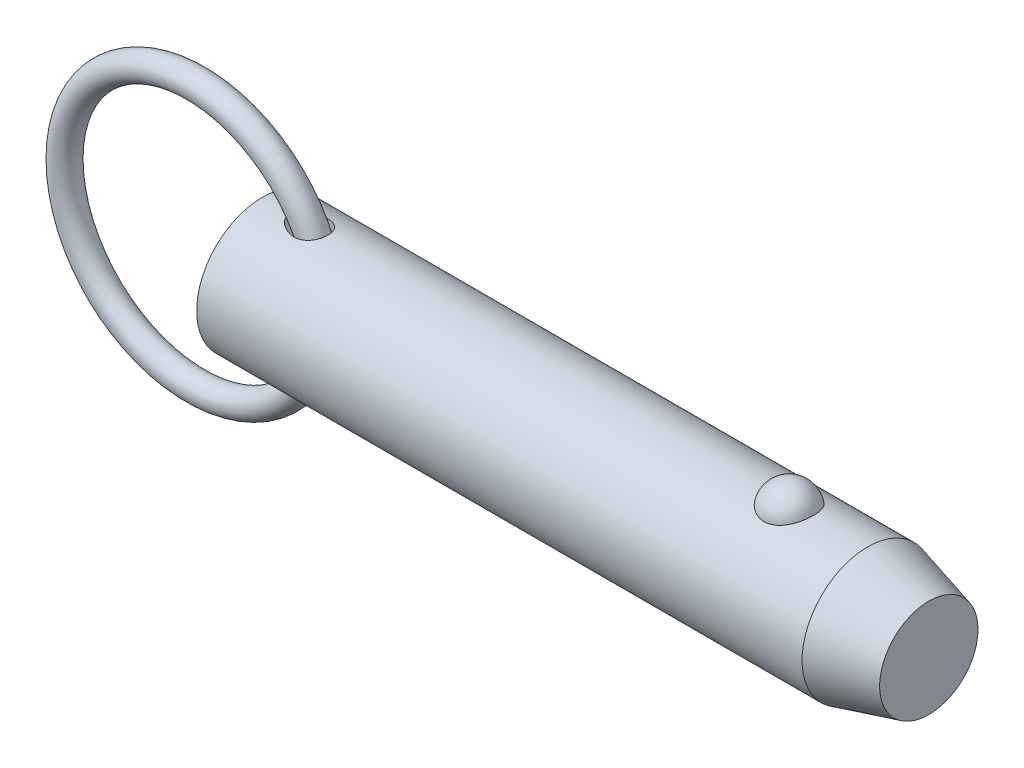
ISO-10303-21;
HEADER;
FILE_DESCRIPTION(('STEP AP214'),'2;1');
FILE_NAME('part.step','',(''),(''),'','','');
FILE_SCHEMA(('AUTOMOTIVE_DESIGN { 1 0 10303 214 1 1 1 1 }'));
ENDSEC;
DATA;
#1=APPLICATION_CONTEXT('core data for automotive mechanical design processes');
#2=APPLICATION_PROTOCOL_DEFINITION('international standard','automotive_design',2000,#1);
#3=PRODUCT_CONTEXT('',#1,'mechanical');
#4=PRODUCT('Part','Part','',(#3));
#5=PRODUCT_RELATED_PRODUCT_CATEGORY('part','',(#4));
#6=PRODUCT_DEFINITION_FORMATION('','',#4);
#7=PRODUCT_DEFINITION_CONTEXT('part definition',#1,'design');
#8=PRODUCT_DEFINITION('design','',#6,#7);
#9=PRODUCT_DEFINITION_SHAPE('','',#8);
#10=(LENGTH_UNIT() NAMED_UNIT(*) SI_UNIT(.MILLI.,.METRE.));
#11=(NAMED_UNIT(*) PLANE_ANGLE_UNIT() SI_UNIT($,.RADIAN.));
#12=(NAMED_UNIT(*) SI_UNIT($,.STERADIAN.) SOLID_ANGLE_UNIT());
#13=UNCERTAINTY_MEASURE_WITH_UNIT(LENGTH_MEASURE(1.E-05),#10,'distance_accuracy_value','');
#14=(GEOMETRIC_REPRESENTATION_CONTEXT(3) GLOBAL_UNCERTAINTY_ASSIGNED_CONTEXT((#13)) GLOBAL_UNIT_ASSIGNED_CONTEXT((#10,
#11,#12)) REPRESENTATION_CONTEXT('',''));
#15=CARTESIAN_POINT('',(0.,0.,0.));
#16=DIRECTION('',(0.,0.,1.));
#17=DIRECTION('',(1.,0.,0.));
#18=AXIS2_PLACEMENT_3D('',#15,#16,#17);
#19=CARTESIAN_POINT('',(-9.66825126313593,0.,0.));
#20=DIRECTION('',(0.,0.,1.));
#21=DIRECTION('',(1.,0.,0.));
#22=AXIS2_PLACEMENT_3D('',#19,#20,#21);
#23=TOROIDAL_SURFACE('',#22,19.05,1.905);
#24=CARTESIAN_POINT('',(11.2867487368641,0.,0.));
#25=VERTEX_POINT('',#24);
#26=VERTEX_LOOP('',#25);
#27=FACE_BOUND('',#26,.T.);
#28=ADVANCED_FACE('P0_F12',(#27),#23,.T.);
#29=CLOSED_SHELL('',(#28));
#30=MANIFOLD_SOLID_BREP('P0_B1',#29);
#31=CARTESIAN_POINT('',(0.,0.,0.));
#32=DIRECTION('',(1.,0.,0.));
#33=DIRECTION('',(0.,0.,-1.));
#34=AXIS2_PLACEMENT_3D('',#31,#32,#33);
#35=CYLINDRICAL_SURFACE('',#34,9.525);
#36=CARTESIAN_POINT('',(4.56693409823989,9.4314194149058,-1.33189820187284));
#37=CARTESIAN_POINT('',(4.70260475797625,9.41020313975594,-1.48215931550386));
#38=CARTESIAN_POINT('',(4.85555680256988,9.38755003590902,-1.61683982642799));
#39=CARTESIAN_POINT('',(5.10171959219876,9.35450554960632,-1.79512943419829));
#40=CARTESIAN_POINT('',(5.18674514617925,9.34362629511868,-1.85068909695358));
#41=CARTESIAN_POINT('',(5.3615438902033,9.32258514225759,-1.95392002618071));
#42=CARTESIAN_POINT('',(5.45131542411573,9.31242299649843,-2.00159402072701));
#43=CARTESIAN_POINT('',(5.70070211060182,9.28632120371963,-2.12033289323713));
#44=CARTESIAN_POINT('',(5.86420408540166,9.27146938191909,-2.18362944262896));
#45=CARTESIAN_POINT('',(6.19893345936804,9.24694163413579,-2.28525783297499));
#46=CARTESIAN_POINT('',(6.3701538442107,9.23726110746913,-2.32361187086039));
#47=CARTESIAN_POINT('',(6.73531776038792,9.22400982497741,-2.37575048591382));
#48=CARTESIAN_POINT('',(6.92975826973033,9.22118808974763,-2.38652934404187));
#49=CARTESIAN_POINT('',(7.21995443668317,9.22416297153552,-2.37494980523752));
#50=CARTESIAN_POINT('',(7.31643847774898,9.22635560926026,-2.366466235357));
#51=CARTESIAN_POINT('',(7.50796421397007,9.2331428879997,-2.33985028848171));
#52=CARTESIAN_POINT('',(7.60300650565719,9.23773650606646,-2.32172202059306));
#53=CARTESIAN_POINT('',(7.83273114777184,9.25183311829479,-2.26504721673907));
#54=CARTESIAN_POINT('',(7.96603028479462,9.26261470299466,-2.2209856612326));
#55=CARTESIAN_POINT('',(8.22310899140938,9.28816519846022,-2.1115730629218));
#56=CARTESIAN_POINT('',(8.34689477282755,9.30293147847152,-2.04623606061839));
#57=CARTESIAN_POINT('',(8.58136049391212,9.3349416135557,-1.89485344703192));
#58=CARTESIAN_POINT('',(8.69199721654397,9.35219324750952,-1.8087422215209));
#59=CARTESIAN_POINT('',(8.89592093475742,9.38707016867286,-1.6179918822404));
#60=CARTESIAN_POINT('',(8.98920771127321,9.40469546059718,-1.51335253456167));
#61=CARTESIAN_POINT('',(9.15057731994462,9.43713590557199,-1.29519427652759));
#62=CARTESIAN_POINT('',(9.21980158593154,9.45205440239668,-1.18253282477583));
#63=CARTESIAN_POINT('',(9.33826736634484,9.47856708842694,-0.946802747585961));
#64=CARTESIAN_POINT('',(9.38751161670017,9.49016173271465,-0.823735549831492));
#65=CARTESIAN_POINT('',(9.46423850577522,9.50859378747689,-0.572614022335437));
#66=CARTESIAN_POINT('',(9.4920239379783,9.5154972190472,-0.444656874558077));
#67=CARTESIAN_POINT('',(9.52636926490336,9.5240690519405,-0.185752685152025));
#68=CARTESIAN_POINT('',(9.53292923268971,9.52573747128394,-0.054805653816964));
#69=CARTESIAN_POINT('',(9.52467276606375,9.52365852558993,0.206503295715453));
#70=CARTESIAN_POINT('',(9.50983454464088,9.51990564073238,0.336864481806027));
#71=CARTESIAN_POINT('',(9.45907362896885,9.50737852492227,0.593166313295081));
#72=CARTESIAN_POINT('',(9.42315106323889,9.49860432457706,0.719106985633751));
#73=CARTESIAN_POINT('',(9.3310664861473,9.4769892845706,0.962959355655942));
#74=CARTESIAN_POINT('',(9.27490839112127,9.46414923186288,1.08087260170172));
#75=CARTESIAN_POINT('',(9.14375803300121,9.43581000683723,1.30534632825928));
#76=CARTESIAN_POINT('',(9.06876720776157,9.42031103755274,1.41190767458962));
#77=CARTESIAN_POINT('',(8.90203187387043,9.38836719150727,1.61069439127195));
#78=CARTESIAN_POINT('',(8.81029913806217,9.371922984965,1.70292975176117));
#79=CARTESIAN_POINT('',(8.6126877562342,9.33985045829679,1.87086859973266));
#80=CARTESIAN_POINT('',(8.50680947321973,9.3242221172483,1.94657251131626));
#81=CARTESIAN_POINT('',(8.28220546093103,9.29513431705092,2.08109032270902));
#82=CARTESIAN_POINT('',(8.16329919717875,9.28171415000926,2.13961034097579));
#83=CARTESIAN_POINT('',(7.91756052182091,9.25859072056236,2.23755716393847));
#84=CARTESIAN_POINT('',(7.79072606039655,9.24888842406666,2.27697900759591));
#85=CARTESIAN_POINT('',(7.52377913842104,9.23338749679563,2.33907806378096));
#86=CARTESIAN_POINT('',(7.3833476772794,9.22789571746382,2.36044900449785));
#87=CARTESIAN_POINT('',(7.1008139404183,9.22210229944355,2.3829751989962));
#88=CARTESIAN_POINT('',(6.95871103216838,9.22180269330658,2.38412253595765));
#89=CARTESIAN_POINT('',(6.65642691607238,9.22632724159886,2.36656230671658));
#90=CARTESIAN_POINT('',(6.49641694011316,9.23185415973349,2.3451317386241));
#91=CARTESIAN_POINT('',(6.18115433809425,9.24811737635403,2.28014143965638));
#92=CARTESIAN_POINT('',(6.02590710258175,9.25885936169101,2.23655754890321));
#93=CARTESIAN_POINT('',(5.69904720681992,9.28624254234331,2.12025087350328));
#94=CARTESIAN_POINT('',(5.52873601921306,9.30354853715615,2.04400672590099));
#95=CARTESIAN_POINT('',(5.20289495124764,9.34106989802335,1.86504730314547));
#96=CARTESIAN_POINT('',(5.0473596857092,9.36128419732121,1.76234172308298));
#97=CARTESIAN_POINT('',(4.7928712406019,9.39697639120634,1.55895334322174));
#98=CARTESIAN_POINT('',(4.68938704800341,9.41240250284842,1.46392900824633));
#99=CARTESIAN_POINT('',(4.4984714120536,9.44202586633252,1.25875918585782));
#100=CARTESIAN_POINT('',(4.41101129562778,9.45622528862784,1.1486413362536));
#101=CARTESIAN_POINT('',(4.27502257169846,9.47888210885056,0.94060098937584));
#102=CARTESIAN_POINT('',(4.22216329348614,9.48791121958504,0.845586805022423));
#103=CARTESIAN_POINT('',(4.13241478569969,9.50344321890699,0.648051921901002));
#104=CARTESIAN_POINT('',(4.0955118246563,9.50994827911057,0.545537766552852));
#105=CARTESIAN_POINT('',(4.04043124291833,9.51971586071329,0.334452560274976));
#106=CARTESIAN_POINT('',(4.02240728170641,9.52295176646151,0.225839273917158));
#107=CARTESIAN_POINT('',(4.00750873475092,9.52562364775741,0.00713006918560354));
#108=CARTESIAN_POINT('',(4.01062334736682,9.52506156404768,-0.102965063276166));
#109=CARTESIAN_POINT('',(4.03592967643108,9.52053221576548,-0.306944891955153));
#110=CARTESIAN_POINT('',(4.05571676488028,9.51699426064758,-0.401151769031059));
#111=CARTESIAN_POINT('',(4.10967975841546,9.5074546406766,-0.585176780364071));
#112=CARTESIAN_POINT('',(4.1438599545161,9.50145224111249,-0.674993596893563));
#113=CARTESIAN_POINT('',(4.23261356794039,9.48611703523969,-0.866116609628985));
#114=CARTESIAN_POINT('',(4.28990016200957,9.47635800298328,-0.966121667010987));
#115=CARTESIAN_POINT('',(4.4185657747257,9.45502867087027,-1.15640011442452));
#116=CARTESIAN_POINT('',(4.4899691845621,9.44345524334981,-1.24665623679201));
#117=CARTESIAN_POINT('',(4.56693409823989,9.4314194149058,-1.33189820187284));
#118=B_SPLINE_CURVE_WITH_KNOTS('',3,(#36,#37,#38,#39,#40,#41,#42,#43,#44,#45,#46,#47,#48,#49,
#50,#51,#52,#53,#54,#55,#56,#57,#58,#59,#60,#61,#62,#63,#64,#65,#66,#67,#68,#69,#70,#71,#72,#73,
#74,#75,#76,#77,#78,#79,#80,#81,#82,#83,#84,#85,#86,#87,#88,#89,#90,#91,#92,#93,#94,#95,#96,#97,
#98,#99,#100,#101,#102,#103,#104,#105,#106,#107,#108,#109,#110,#111,#112,#113,#114,#115,#116,
#117),.UNSPECIFIED.,.T.,.F.,(4,2,2,2,2,2,2,2,2,2,2,2,2,2,2,2,2,2,2,2,2,2,2,2,2,2,2,2,2,2,2,2,2,
2,2,2,2,2,2,2,4),(0.,0.609951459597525,0.916123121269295,1.22218863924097,1.74791337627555,
2.27316961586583,2.85362722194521,3.14383229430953,3.43391382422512,3.85437497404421,
4.27455920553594,4.69608835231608,5.11762282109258,5.51490051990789,5.91212379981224,
6.30363414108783,6.69514313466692,7.0870510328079,7.47895654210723,7.87078624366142,
8.26258603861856,8.65411137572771,9.0456266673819,9.44349251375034,9.84146165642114,
10.2662286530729,10.6911619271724,11.1739180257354,11.6572017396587,12.2170157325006,
12.776624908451,13.1992556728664,13.6211226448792,13.9471990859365,14.2729943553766,
14.6014211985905,14.9296802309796,15.2173810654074,15.505167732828,15.8505863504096,
16.1966070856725),.UNSPECIFIED.);
#119=CARTESIAN_POINT('',(4.56693409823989,9.4314194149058,-1.33189820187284));
#120=VERTEX_POINT('',#119);
#121=EDGE_CURVE('P1_E40',#120,#120,#118,.T.);
#122=ORIENTED_EDGE('',*,*,#121,.T.);
#123=EDGE_LOOP('',(#122));
#124=FACE_BOUND('',#123,.T.);
#125=CARTESIAN_POINT('',(87.9430540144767,0.,0.));
#126=DIRECTION('',(1.,0.,0.));
#127=DIRECTION('',(0.,0.,-1.));
#128=AXIS2_PLACEMENT_3D('',#125,#126,#127);
#129=CIRCLE('',#128,9.525);
#130=CARTESIAN_POINT('',(87.9430540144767,0.,-9.525));
#131=VERTEX_POINT('',#130);
#132=EDGE_CURVE('P1_E25',#131,#131,#129,.T.);
#133=ORIENTED_EDGE('',*,*,#132,.F.);
#134=EDGE_LOOP('',(#133));
#135=FACE_BOUND('',#134,.T.);
#136=CARTESIAN_POINT('',(0.,0.,0.));
#137=DIRECTION('',(1.,0.,0.));
#138=DIRECTION('',(0.,0.,-1.));
#139=AXIS2_PLACEMENT_3D('',#136,#137,#138);
#140=CIRCLE('',#139,9.525);
#141=CARTESIAN_POINT('',(0.,0.,-9.525));
#142=VERTEX_POINT('',#141);
#143=EDGE_CURVE('P1_E9',#142,#142,#140,.T.);
#144=ORIENTED_EDGE('',*,*,#143,.T.);
#145=EDGE_LOOP('',(#144));
#146=FACE_BOUND('',#145,.T.);
#147=CARTESIAN_POINT('',(76.5457573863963,8.80405803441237,3.63513233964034));
#148=CARTESIAN_POINT('',(76.4516766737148,8.80405953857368,3.63513053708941));
#149=CARTESIAN_POINT('',(76.3575618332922,8.80561325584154,3.63137461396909));
#150=CARTESIAN_POINT('',(76.1700126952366,8.81177748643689,3.61638665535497));
#151=CARTESIAN_POINT('',(76.0765788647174,8.81638992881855,3.60514990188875));
#152=CARTESIAN_POINT('',(75.7979452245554,8.83467114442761,3.56024627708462));
#153=CARTESIAN_POINT('',(75.6146916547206,8.85278327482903,3.5153862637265));
#154=CARTESIAN_POINT('',(75.259509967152,8.89871214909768,3.39742145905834));
#155=CARTESIAN_POINT('',(75.0875533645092,8.92650327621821,3.32439116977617));
#156=CARTESIAN_POINT('',(74.758707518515,8.98874819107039,3.15220244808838));
#157=CARTESIAN_POINT('',(74.6018114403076,9.02319893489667,3.05305594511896));
#158=CARTESIAN_POINT('',(74.3022147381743,9.09629186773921,2.82797815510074));
#159=CARTESIAN_POINT('',(74.1600600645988,9.13502685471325,2.70135138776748));
#160=CARTESIAN_POINT('',(73.8982999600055,9.2118657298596,2.42641932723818));
#161=CARTESIAN_POINT('',(73.7787015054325,9.24996941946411,2.27810735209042));
#162=CARTESIAN_POINT('',(73.559645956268,9.32341082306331,1.95652290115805));
#163=CARTESIAN_POINT('',(73.4613174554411,9.35855090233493,1.78243511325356));
#164=CARTESIAN_POINT('',(73.2938190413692,9.42045142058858,1.419372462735));
#165=CARTESIAN_POINT('',(73.2246511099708,9.44721128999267,1.23039658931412));
#166=CARTESIAN_POINT('',(73.1161994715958,9.48990641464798,0.840370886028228));
#167=CARTESIAN_POINT('',(73.0772880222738,9.50570658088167,0.639202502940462));
#168=CARTESIAN_POINT('',(73.0315550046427,9.52433146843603,0.232664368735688));
#169=CARTESIAN_POINT('',(73.0247324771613,9.52715657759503,0.0272947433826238));
#170=CARTESIAN_POINT('',(73.043255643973,9.51956918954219,-0.380478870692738));
#171=CARTESIAN_POINT('',(73.0684052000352,9.50923740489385,-0.58289331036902));
#172=CARTESIAN_POINT('',(73.1500253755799,9.47651897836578,-0.980293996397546));
#173=CARTESIAN_POINT('',(73.2064966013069,9.45413210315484,-1.17528009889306));
#174=CARTESIAN_POINT('',(73.3497192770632,9.39954044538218,-1.55263697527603));
#175=CARTESIAN_POINT('',(73.4365124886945,9.36732213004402,-1.73498993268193));
#176=CARTESIAN_POINT('',(73.6386103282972,9.29640700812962,-2.08177763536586));
#177=CARTESIAN_POINT('',(73.7539172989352,9.25770966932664,-2.24621090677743));
#178=CARTESIAN_POINT('',(74.011264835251,9.17775604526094,-2.5533833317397));
#179=CARTESIAN_POINT('',(74.1534344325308,9.136488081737,-2.696011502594));
#180=CARTESIAN_POINT('',(74.46089985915,9.05620497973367,-2.95451229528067));
#181=CARTESIAN_POINT('',(74.626193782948,9.01718965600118,-3.070387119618));
#182=CARTESIAN_POINT('',(74.972052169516,8.94680019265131,-3.26976836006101));
#183=CARTESIAN_POINT('',(75.1522278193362,8.91528408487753,-3.353897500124));
#184=CARTESIAN_POINT('',(75.5256514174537,8.86272514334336,-3.49043503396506));
#185=CARTESIAN_POINT('',(75.718894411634,8.84167836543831,-3.54285537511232));
#186=CARTESIAN_POINT('',(76.1025036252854,8.81348056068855,-3.61241306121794));
#187=CARTESIAN_POINT('',(76.2925251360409,8.80568348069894,-3.6311933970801));
#188=CARTESIAN_POINT('',(76.6731906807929,8.80289410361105,-3.63795342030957));
#189=CARTESIAN_POINT('',(76.8638345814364,8.80789922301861,-3.62593932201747));
#190=CARTESIAN_POINT('',(77.234007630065,8.82974915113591,-3.57238430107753));
#191=CARTESIAN_POINT('',(77.4136976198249,8.84621463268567,-3.53178890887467));
#192=CARTESIAN_POINT('',(77.7634226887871,8.88875330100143,-3.42331083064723));
#193=CARTESIAN_POINT('',(77.9334569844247,8.91482726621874,-3.35542593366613));
#194=CARTESIAN_POINT('',(78.2632377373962,8.97448239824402,-3.19248225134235));
#195=CARTESIAN_POINT('',(78.4226801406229,9.00821446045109,-3.0968647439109));
#196=CARTESIAN_POINT('',(78.7235136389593,9.07935398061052,-2.88162736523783));
#197=CARTESIAN_POINT('',(78.8649005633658,9.11676228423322,-2.76200196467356));
#198=CARTESIAN_POINT('',(79.1333193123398,9.19347419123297,-2.49516285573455));
#199=CARTESIAN_POINT('',(79.2592750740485,9.23277872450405,-2.34686614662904));
#200=CARTESIAN_POINT('',(79.4855227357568,9.3073761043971,-2.03093683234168));
#201=CARTESIAN_POINT('',(79.5858100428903,9.3426682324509,-1.86330077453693));
#202=CARTESIAN_POINT('',(79.7615149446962,9.40674710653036,-1.50744893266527));
#203=CARTESIAN_POINT('',(79.836041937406,9.43529176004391,-1.31874876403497));
#204=CARTESIAN_POINT('',(79.9541650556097,9.48144132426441,-0.930631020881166));
#205=CARTESIAN_POINT('',(79.9977608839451,9.49904612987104,-0.731213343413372));
#206=CARTESIAN_POINT('',(80.0531580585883,9.5215314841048,-0.327147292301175));
#207=CARTESIAN_POINT('',(80.0649354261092,9.52640243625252,-0.122495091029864));
#208=CARTESIAN_POINT('',(80.0563825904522,9.5228957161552,0.286018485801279));
#209=CARTESIAN_POINT('',(80.0360530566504,9.5145183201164,0.489879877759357));
#210=CARTESIAN_POINT('',(79.9638840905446,9.48544083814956,0.889994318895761));
#211=CARTESIAN_POINT('',(79.9121993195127,9.46480124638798,1.08627971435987));
#212=CARTESIAN_POINT('',(79.7784917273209,9.4133389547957,1.46682086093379));
#213=CARTESIAN_POINT('',(79.6964668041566,9.38251554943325,1.65107577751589));
#214=CARTESIAN_POINT('',(79.5031929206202,9.31365636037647,2.00346348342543));
#215=CARTESIAN_POINT('',(79.3917838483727,9.27558138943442,2.17150083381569));
#216=CARTESIAN_POINT('',(79.1422947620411,9.19638714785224,2.4856311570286));
#217=CARTESIAN_POINT('',(79.0042163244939,9.15526805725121,2.63172542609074));
#218=CARTESIAN_POINT('',(78.7048438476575,9.07465393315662,2.89750997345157));
#219=CARTESIAN_POINT('',(78.5436109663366,9.03515496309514,3.01726776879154));
#220=CARTESIAN_POINT('',(78.2016136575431,8.96227564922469,3.22732920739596));
#221=CARTESIAN_POINT('',(78.020841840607,8.92889763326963,3.31762165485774));
#222=CARTESIAN_POINT('',(77.6514451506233,8.8734538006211,3.46314419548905));
#223=CARTESIAN_POINT('',(77.4633237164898,8.85102983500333,3.51950082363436));
#224=CARTESIAN_POINT('',(77.1757869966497,8.8266696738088,3.57993683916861));
#225=CARTESIAN_POINT('',(77.0791339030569,8.82009725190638,3.5960621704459));
#226=CARTESIAN_POINT('',(76.8846770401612,8.81020897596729,3.62022512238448));
#227=CARTESIAN_POINT('',(76.7868741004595,8.80689090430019,3.62826825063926));
#228=CARTESIAN_POINT('',(76.6412243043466,8.80445615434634,3.63416760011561));
#229=CARTESIAN_POINT('',(76.5934952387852,8.80405727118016,3.63513325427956));
#230=CARTESIAN_POINT('',(76.5457573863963,8.80405803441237,3.63513233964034));
#231=B_SPLINE_CURVE_WITH_KNOTS('',3,(#147,#148,#149,#150,#151,#152,#153,#154,#155,#156,#157,
#158,#159,#160,#161,#162,#163,#164,#165,#166,#167,#168,#169,#170,#171,#172,#173,#174,#175,#176,
#177,#178,#179,#180,#181,#182,#183,#184,#185,#186,#187,#188,#189,#190,#191,#192,#193,#194,#195,
#196,#197,#198,#199,#200,#201,#202,#203,#204,#205,#206,#207,#208,#209,#210,#211,#212,#213,#214,
#215,#216,#217,#218,#219,#220,#221,#222,#223,#224,#225,#226,#227,#228,#229,#230),.UNSPECIFIED.,
.T.,.F.,(4,2,2,2,2,2,2,2,2,2,2,2,2,2,2,2,2,2,2,2,2,2,2,2,2,2,2,2,2,2,2,2,2,2,2,2,2,2,2,2,2,4),
(0.,0.282202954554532,0.564584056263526,1.13017050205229,1.69427128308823,2.25811483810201,
2.83836627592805,3.4187968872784,4.02497117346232,4.63118665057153,5.24474754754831,
5.85829010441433,6.46808687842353,7.07789545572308,7.68854723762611,8.29924920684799,
8.9129628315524,9.52662591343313,10.1275338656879,10.7282152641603,11.2986646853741,
11.8689989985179,12.4213015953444,12.973648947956,13.5380053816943,14.1024919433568,
14.695298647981,15.2882113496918,15.8999469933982,16.5116885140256,17.1238909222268,
17.7360805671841,18.3452748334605,18.9545113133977,19.567138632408,20.179729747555,
20.7907316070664,21.4019653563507,21.9915938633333,22.2859053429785,22.5800161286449,
22.7232098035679),.UNSPECIFIED.);
#232=CARTESIAN_POINT('',(76.5457573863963,8.80405803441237,3.63513233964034));
#233=VERTEX_POINT('',#232);
#234=EDGE_CURVE('P1_E34',#233,#233,#231,.T.);
#235=ORIENTED_EDGE('',*,*,#234,.T.);
#236=EDGE_LOOP('',(#235));
#237=FACE_BOUND('',#236,.T.);
#238=CARTESIAN_POINT('',(4.56693409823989,-9.4314194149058,-1.33189820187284));
#239=CARTESIAN_POINT('',(4.48932984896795,-9.4435553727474,-1.24594548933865));
#240=CARTESIAN_POINT('',(4.41737309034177,-9.45522193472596,-1.1548795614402));
#241=CARTESIAN_POINT('',(4.2878104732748,-9.47670896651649,-0.962782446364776));
#242=CARTESIAN_POINT('',(4.23019403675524,-9.48653079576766,-0.861758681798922));
#243=CARTESIAN_POINT('',(4.132545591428,-9.5034118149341,-0.649723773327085));
#244=CARTESIAN_POINT('',(4.09271158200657,-9.51043980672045,-0.538615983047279));
#245=CARTESIAN_POINT('',(4.04973167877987,-9.51806966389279,-0.367764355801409));
#246=CARTESIAN_POINT('',(4.03820037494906,-9.52012756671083,-0.310118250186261));
#247=CARTESIAN_POINT('',(4.02100287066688,-9.52320274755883,-0.193935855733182));
#248=CARTESIAN_POINT('',(4.01533565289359,-9.52422020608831,-0.135399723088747));
#249=CARTESIAN_POINT('',(4.0081707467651,-9.52550497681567,0.0247266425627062));
#250=CARTESIAN_POINT('',(4.01270492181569,-9.52468821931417,0.126661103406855));
#251=CARTESIAN_POINT('',(4.03954973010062,-9.51988506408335,0.328012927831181));
#252=CARTESIAN_POINT('',(4.06186450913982,-9.51589792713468,0.427429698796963));
#253=CARTESIAN_POINT('',(4.12088980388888,-9.50548528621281,0.616362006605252));
#254=CARTESIAN_POINT('',(4.15684838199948,-9.49918763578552,0.706123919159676));
#255=CARTESIAN_POINT('',(4.24094647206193,-9.48470618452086,0.879522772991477));
#256=CARTESIAN_POINT('',(4.28909090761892,-9.47652162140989,0.963157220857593));
#257=CARTESIAN_POINT('',(4.42295891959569,-9.45426317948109,1.16513741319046));
#258=CARTESIAN_POINT('',(4.51523752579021,-9.43933320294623,1.27905352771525));
#259=CARTESIAN_POINT('',(4.71682295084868,-9.40825940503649,1.49055892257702));
#260=CARTESIAN_POINT('',(4.82617286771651,-9.39211256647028,1.58810554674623));
#261=CARTESIAN_POINT('',(5.09064226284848,-9.35555264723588,1.79246125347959));
#262=CARTESIAN_POINT('',(5.2499041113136,-9.33524115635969,1.89393122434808));
#263=CARTESIAN_POINT('',(5.58309255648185,-9.29785396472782,2.06968659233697));
#264=CARTESIAN_POINT('',(5.75702897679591,-9.28078045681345,2.14395359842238));
#265=CARTESIAN_POINT('',(6.11646882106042,-9.25213303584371,2.26440412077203));
#266=CARTESIAN_POINT('',(6.30205582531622,-9.2406056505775,2.31035092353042));
#267=CARTESIAN_POINT('',(6.67856093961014,-9.22541807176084,2.37029728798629));
#268=CARTESIAN_POINT('',(6.8694704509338,-9.2217458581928,2.3843456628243));
#269=CARTESIAN_POINT('',(7.21217144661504,-9.2234423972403,2.37775005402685));
#270=CARTESIAN_POINT('',(7.36409439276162,-9.22713860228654,2.36352577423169));
#271=CARTESIAN_POINT('',(7.66346227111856,-9.24048072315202,2.31082299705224));
#272=CARTESIAN_POINT('',(7.81090958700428,-9.25012341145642,2.27235765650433));
#273=CARTESIAN_POINT('',(8.09730316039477,-9.2746609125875,2.17003648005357));
#274=CARTESIAN_POINT('',(8.23619652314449,-9.28958517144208,2.10603803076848));
#275=CARTESIAN_POINT('',(8.49918675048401,-9.32290326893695,1.95324442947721));
#276=CARTESIAN_POINT('',(8.62328895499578,-9.34129584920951,1.86445826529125));
#277=CARTESIAN_POINT('',(8.84006515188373,-9.37706953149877,1.67466761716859));
#278=CARTESIAN_POINT('',(8.93465172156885,-9.39436331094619,1.57582357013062));
#279=CARTESIAN_POINT('',(9.1049023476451,-9.42761680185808,1.362809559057));
#280=CARTESIAN_POINT('',(9.18057146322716,-9.44357686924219,1.24864370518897));
#281=CARTESIAN_POINT('',(9.30789178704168,-9.47159985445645,1.01379272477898));
#282=CARTESIAN_POINT('',(9.36045544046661,-9.48380365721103,0.893617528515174));
#283=CARTESIAN_POINT('',(9.44498362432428,-9.50388751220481,0.645890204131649));
#284=CARTESIAN_POINT('',(9.47694947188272,-9.51176784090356,0.518338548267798));
#285=CARTESIAN_POINT('',(9.51944262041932,-9.52232073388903,0.260103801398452));
#286=CARTESIAN_POINT('',(9.53006646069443,-9.52501674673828,0.129437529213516));
#287=CARTESIAN_POINT('',(9.52993291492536,-9.52498309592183,-0.131885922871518));
#288=CARTESIAN_POINT('',(9.5191752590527,-9.52225336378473,-0.262543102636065));
#289=CARTESIAN_POINT('',(9.47648788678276,-9.51165418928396,-0.520312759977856));
#290=CARTESIAN_POINT('',(9.44453086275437,-9.50377811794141,-0.647420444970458));
#291=CARTESIAN_POINT('',(9.36015568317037,-9.48373425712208,-0.894290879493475));
#292=CARTESIAN_POINT('',(9.30773827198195,-9.47156662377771,-1.01405389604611));
#293=CARTESIAN_POINT('',(9.1838089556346,-9.44428888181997,-1.24269386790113));
#294=CARTESIAN_POINT('',(9.11232064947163,-9.42918241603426,-1.35158405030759));
#295=CARTESIAN_POINT('',(8.9521268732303,-9.39767706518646,-1.55562459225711));
#296=CARTESIAN_POINT('',(8.86342281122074,-9.3812782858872,-1.65077607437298));
#297=CARTESIAN_POINT('',(8.67104443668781,-9.34891827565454,-1.8251751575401));
#298=CARTESIAN_POINT('',(8.56732858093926,-9.33295841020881,-1.90437711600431));
#299=CARTESIAN_POINT('',(8.34818438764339,-9.30317889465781,-2.0449122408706));
#300=CARTESIAN_POINT('',(8.23275529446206,-9.28935938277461,-2.10624425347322));
#301=CARTESIAN_POINT('',(7.98961240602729,-9.26475003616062,-2.2120340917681));
#302=CARTESIAN_POINT('',(7.86162088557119,-9.25407358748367,-2.25587700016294));
#303=CARTESIAN_POINT('',(7.60027499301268,-9.23720810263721,-2.32397032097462));
#304=CARTESIAN_POINT('',(7.46691858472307,-9.23102078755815,-2.34821321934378));
#305=CARTESIAN_POINT('',(7.18516230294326,-9.22302718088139,-2.37943079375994));
#306=CARTESIAN_POINT('',(7.03654454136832,-9.22169704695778,-2.38452997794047));
#307=CARTESIAN_POINT('',(6.7401504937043,-9.22442327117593,-2.37395141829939));
#308=CARTESIAN_POINT('',(6.59237455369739,-9.22848170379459,-2.35826567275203));
#309=CARTESIAN_POINT('',(6.27762777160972,-9.2422287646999,-2.30385559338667));
#310=CARTESIAN_POINT('',(6.11124715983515,-9.25269504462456,-2.26192683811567));
#311=CARTESIAN_POINT('',(5.78635920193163,-9.27830776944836,-2.15445569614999));
#312=CARTESIAN_POINT('',(5.62786567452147,-9.29346211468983,-2.08887341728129));
#313=CARTESIAN_POINT('',(5.39013065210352,-9.31931237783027,-1.96924953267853));
#314=CARTESIAN_POINT('',(5.30683088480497,-9.32901725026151,-1.92292485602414));
#315=CARTESIAN_POINT('',(5.1445580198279,-9.34899035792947,-1.82334419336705));
#316=CARTESIAN_POINT('',(5.06558607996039,-9.35925874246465,-1.77008636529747));
#317=CARTESIAN_POINT('',(4.83670950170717,-9.39034445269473,-1.60010986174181));
#318=CARTESIAN_POINT('',(4.69422471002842,-9.41151337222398,-1.47288240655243));
#319=CARTESIAN_POINT('',(4.56693409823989,-9.4314194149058,-1.33189820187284));
#320=B_SPLINE_CURVE_WITH_KNOTS('',3,(#238,#239,#240,#241,#242,#243,#244,#245,#246,#247,#248,
#249,#250,#251,#252,#253,#254,#255,#256,#257,#258,#259,#260,#261,#262,#263,#264,#265,#266,#267,
#268,#269,#270,#271,#272,#273,#274,#275,#276,#277,#278,#279,#280,#281,#282,#283,#284,#285,#286,
#287,#288,#289,#290,#291,#292,#293,#294,#295,#296,#297,#298,#299,#300,#301,#302,#303,#304,#305,
#306,#307,#308,#309,#310,#311,#312,#313,#314,#315,#316,#317,#318,#319),.UNSPECIFIED.,.T.,.F.,(4,
2,2,2,2,2,2,2,2,2,2,2,2,2,2,2,2,2,2,2,2,2,2,2,2,2,2,2,2,2,2,2,2,2,2,2,2,2,2,2,4),(0.,
0.348900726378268,0.697543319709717,1.0499765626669,1.22617690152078,1.40234666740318,
1.70666745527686,2.01105922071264,2.30066493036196,2.59038784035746,3.03001384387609,
3.4707682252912,4.03766594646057,4.60494622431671,5.17690598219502,5.74798989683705,
6.20400848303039,6.65977977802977,7.11813321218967,7.57632066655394,7.98791759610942,
8.39940433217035,8.79273459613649,9.18603970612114,9.57756168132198,9.96908859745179,
10.3611208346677,10.7531388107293,11.1446739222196,11.536177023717,11.9287850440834,
12.3214184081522,12.7268448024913,13.1324265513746,13.5768390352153,14.0214226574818,
14.5351685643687,15.0497849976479,15.3368801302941,15.6240516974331,16.1963372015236),.UNSPECIFIED.);
#321=CARTESIAN_POINT('',(4.56693409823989,-9.4314194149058,-1.33189820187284));
#322=VERTEX_POINT('',#321);
#323=EDGE_CURVE('P1_E17',#322,#322,#320,.T.);
#324=ORIENTED_EDGE('',*,*,#323,.T.);
#325=EDGE_LOOP('',(#324));
#326=FACE_BOUND('',#325,.T.);
#327=ADVANCED_FACE('P1_F13',(#124,#135,#146,#237,#326),#35,.T.);
#328=CARTESIAN_POINT('',(0.,0.,0.));
#329=DIRECTION('',(-1.,0.,0.));
#330=DIRECTION('',(0.,0.,1.));
#331=AXIS2_PLACEMENT_3D('',#328,#329,#330);
#332=PLANE('',#331);
#333=ORIENTED_EDGE('',*,*,#143,.F.);
#334=EDGE_LOOP('',(#333));
#335=FACE_BOUND('',#334,.T.);
#336=ADVANCED_FACE('P1_F15',(#335),#332,.T.);
#337=CARTESIAN_POINT('',(96.83,0.,0.));
#338=DIRECTION('',(-1.,0.,0.));
#339=DIRECTION('',(0.,0.,1.));
#340=AXIS2_PLACEMENT_3D('',#337,#338,#339);
#341=CONICAL_SURFACE('',#340,7.14375000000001,0.26179938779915);
#342=ORIENTED_EDGE('',*,*,#132,.T.);
#343=EDGE_LOOP('',(#342));
#344=FACE_BOUND('',#343,.T.);
#345=CARTESIAN_POINT('',(96.83,0.,0.));
#346=DIRECTION('',(1.,0.,0.));
#347=DIRECTION('',(0.,0.,-1.));
#348=AXIS2_PLACEMENT_3D('',#345,#346,#347);
#349=CIRCLE('',#348,7.14375000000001);
#350=CARTESIAN_POINT('',(96.83,0.,-7.14375000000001));
#351=VERTEX_POINT('',#350);
#352=EDGE_CURVE('P1_E30',#351,#351,#349,.T.);
#353=ORIENTED_EDGE('',*,*,#352,.F.);
#354=EDGE_LOOP('',(#353));
#355=FACE_BOUND('',#354,.T.);
#356=ADVANCED_FACE('P1_F55',(#344,#355),#341,.T.);
#357=CARTESIAN_POINT('',(96.83,7.14375000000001,0.));
#358=DIRECTION('',(1.,0.,0.));
#359=DIRECTION('',(0.,0.,-1.));
#360=AXIS2_PLACEMENT_3D('',#357,#358,#359);
#361=PLANE('',#360);
#362=ORIENTED_EDGE('',*,*,#352,.T.);
#363=EDGE_LOOP('',(#362));
#364=FACE_BOUND('',#363,.T.);
#365=ADVANCED_FACE('P1_F51',(#364),#361,.T.);
#366=CARTESIAN_POINT('',(76.5457573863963,8.5725,0.));
#367=DIRECTION('',(-1.,0.,0.));
#368=DIRECTION('',(0.,1.,0.));
#369=AXIS2_PLACEMENT_3D('',#366,#367,#368);
#370=SPHERICAL_SURFACE('',#369,3.64249999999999);
#371=ORIENTED_EDGE('',*,*,#234,.F.);
#372=EDGE_LOOP('',(#371));
#373=FACE_BOUND('',#372,.T.);
#374=ADVANCED_FACE('P1_F46',(#373),#370,.T.);
#375=CARTESIAN_POINT('',(-9.66825126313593,0.,0.));
#376=DIRECTION('',(0.,0.,1.));
#377=DIRECTION('',(1.,0.,0.));
#378=AXIS2_PLACEMENT_3D('',#375,#376,#377);
#379=TOROIDAL_SURFACE('',#378,19.05,2.38125);
#380=ORIENTED_EDGE('',*,*,#323,.F.);
#381=EDGE_LOOP('',(#380));
#382=FACE_BOUND('',#381,.T.);
#383=ORIENTED_EDGE('',*,*,#121,.F.);
#384=EDGE_LOOP('',(#383));
#385=FACE_BOUND('',#384,.T.);
#386=ADVANCED_FACE('P1_F50',(#382,#385),#379,.F.);
#387=CLOSED_SHELL('',(#327,#336,#356,#365,#374,#386));
#388=MANIFOLD_SOLID_BREP('P1_B1',#387);
#389=ADVANCED_BREP_SHAPE_REPRESENTATION('',(#18,#30,#388),#14);
#390=SHAPE_DEFINITION_REPRESENTATION(#9,#389);
ENDSEC;
END-ISO-10303-21;
